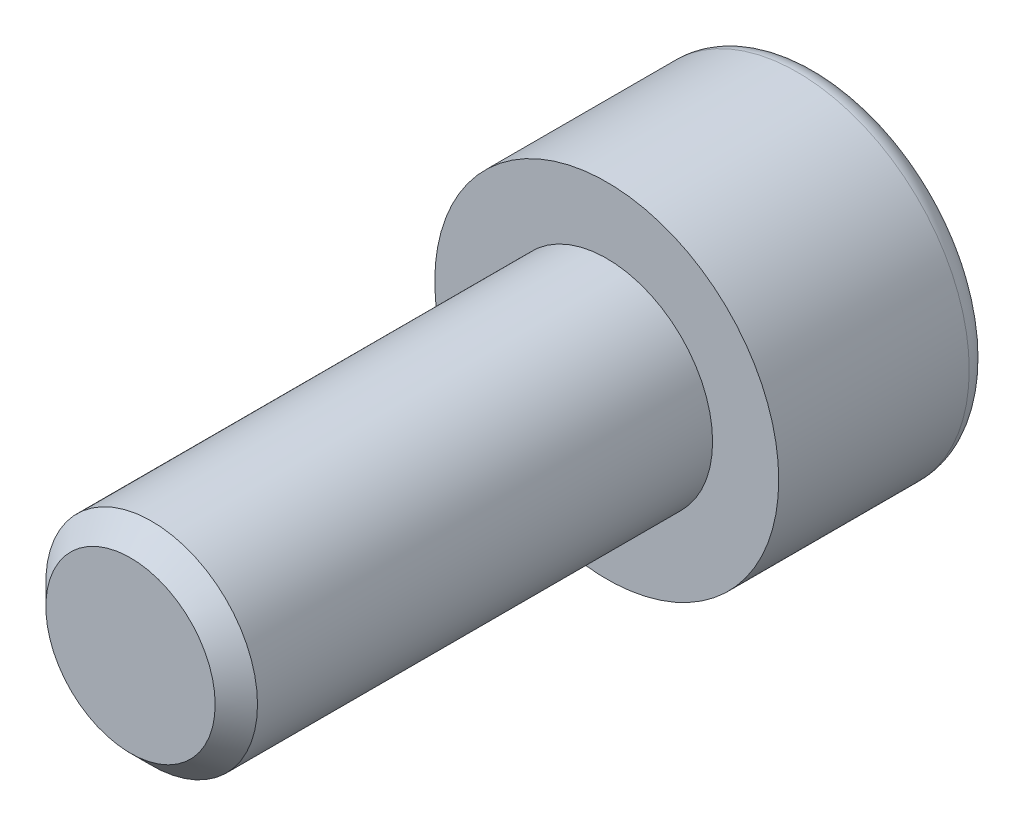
ISO-10303-21;
HEADER;
FILE_DESCRIPTION(('STEP AP214'),'2;1');
FILE_NAME('part.step','',(''),(''),'','','');
FILE_SCHEMA(('AUTOMOTIVE_DESIGN { 1 0 10303 214 1 1 1 1 }'));
ENDSEC;
DATA;
#1=APPLICATION_CONTEXT('core data for automotive mechanical design processes');
#2=APPLICATION_PROTOCOL_DEFINITION('international standard','automotive_design',2000,#1);
#3=PRODUCT_CONTEXT('',#1,'mechanical');
#4=PRODUCT('Part','Part','',(#3));
#5=PRODUCT_RELATED_PRODUCT_CATEGORY('part','',(#4));
#6=PRODUCT_DEFINITION_FORMATION('','',#4);
#7=PRODUCT_DEFINITION_CONTEXT('part definition',#1,'design');
#8=PRODUCT_DEFINITION('design','',#6,#7);
#9=PRODUCT_DEFINITION_SHAPE('','',#8);
#10=(LENGTH_UNIT() NAMED_UNIT(*) SI_UNIT(.MILLI.,.METRE.));
#11=(NAMED_UNIT(*) PLANE_ANGLE_UNIT() SI_UNIT($,.RADIAN.));
#12=(NAMED_UNIT(*) SI_UNIT($,.STERADIAN.) SOLID_ANGLE_UNIT());
#13=UNCERTAINTY_MEASURE_WITH_UNIT(LENGTH_MEASURE(1.E-05),#10,'distance_accuracy_value','');
#14=(GEOMETRIC_REPRESENTATION_CONTEXT(3) GLOBAL_UNCERTAINTY_ASSIGNED_CONTEXT((#13)) GLOBAL_UNIT_ASSIGNED_CONTEXT((#10,
#11,#12)) REPRESENTATION_CONTEXT('',''));
#15=CARTESIAN_POINT('',(0.,0.,0.));
#16=DIRECTION('',(0.,0.,1.));
#17=DIRECTION('',(1.,0.,0.));
#18=AXIS2_PLACEMENT_3D('',#15,#16,#17);
#19=CARTESIAN_POINT('',(0.,0.,-8.));
#20=DIRECTION('',(0.,0.,1.));
#21=DIRECTION('',(1.,0.,0.));
#22=AXIS2_PLACEMENT_3D('',#19,#20,#21);
#23=PLANE('',#22);
#24=CARTESIAN_POINT('',(0.,0.,-8.));
#25=DIRECTION('',(0.,0.,-1.));
#26=DIRECTION('',(-1.,0.,0.));
#27=AXIS2_PLACEMENT_3D('',#24,#25,#26);
#28=CIRCLE('',#27,5.7);
#29=CARTESIAN_POINT('',(-5.7,0.,-8.));
#30=VERTEX_POINT('',#29);
#31=EDGE_CURVE('E141',#30,#30,#28,.T.);
#32=ORIENTED_EDGE('',*,*,#31,.T.);
#33=EDGE_LOOP('',(#32));
#34=FACE_BOUND('',#33,.T.);
#35=DIRECTION('',(-0.86602540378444,0.499999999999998,0.));
#36=VECTOR('',#35,1.);
#37=CARTESIAN_POINT('',(0.,3.46410161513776,-8.));
#38=LINE('',#37,#36);
#39=CARTESIAN_POINT('',(3.,1.73205080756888,-8.));
#40=VERTEX_POINT('',#39);
#41=CARTESIAN_POINT('',(0.,3.46410161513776,-8.));
#42=VERTEX_POINT('',#41);
#43=EDGE_CURVE('E45',#40,#42,#38,.T.);
#44=ORIENTED_EDGE('',*,*,#43,.T.);
#45=DIRECTION('',(-0.866025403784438,-0.500000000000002,0.));
#46=VECTOR('',#45,1.);
#47=CARTESIAN_POINT('',(0.,3.46410161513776,-8.));
#48=LINE('',#47,#46);
#49=CARTESIAN_POINT('',(-3.,1.73205080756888,-8.));
#50=VERTEX_POINT('',#49);
#51=EDGE_CURVE('E85',#42,#50,#48,.T.);
#52=ORIENTED_EDGE('',*,*,#51,.T.);
#53=DIRECTION('',(0.,-1.,0.));
#54=VECTOR('',#53,1.);
#55=CARTESIAN_POINT('',(-3.,-1.73205080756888,-8.));
#56=LINE('',#55,#54);
#57=CARTESIAN_POINT('',(-3.,-1.73205080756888,-8.));
#58=VERTEX_POINT('',#57);
#59=EDGE_CURVE('E93',#50,#58,#56,.T.);
#60=ORIENTED_EDGE('',*,*,#59,.T.);
#61=DIRECTION('',(0.866025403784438,-0.500000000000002,0.));
#62=VECTOR('',#61,1.);
#63=CARTESIAN_POINT('',(0.,-3.46410161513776,-8.));
#64=LINE('',#63,#62);
#65=CARTESIAN_POINT('',(0.,-3.46410161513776,-8.));
#66=VERTEX_POINT('',#65);
#67=EDGE_CURVE('E111',#58,#66,#64,.T.);
#68=ORIENTED_EDGE('',*,*,#67,.T.);
#69=DIRECTION('',(0.86602540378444,0.499999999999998,0.));
#70=VECTOR('',#69,1.);
#71=CARTESIAN_POINT('',(0.,-3.46410161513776,-8.));
#72=LINE('',#71,#70);
#73=CARTESIAN_POINT('',(3.,-1.73205080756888,-8.));
#74=VERTEX_POINT('',#73);
#75=EDGE_CURVE('E114',#66,#74,#72,.T.);
#76=ORIENTED_EDGE('',*,*,#75,.T.);
#77=DIRECTION('',(0.,1.,0.));
#78=VECTOR('',#77,1.);
#79=CARTESIAN_POINT('',(3.,-1.73205080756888,-8.));
#80=LINE('',#79,#78);
#81=EDGE_CURVE('E104',#74,#40,#80,.T.);
#82=ORIENTED_EDGE('',*,*,#81,.T.);
#83=EDGE_LOOP('',(#44,#52,#60,#68,#76,#82));
#84=FACE_BOUND('',#83,.T.);
#85=ADVANCED_FACE('F31',(#34,#84),#23,.F.);
#86=CARTESIAN_POINT('',(0.,0.,-7.2));
#87=DIRECTION('',(0.,0.,-1.));
#88=DIRECTION('',(-1.,0.,0.));
#89=AXIS2_PLACEMENT_3D('',#86,#87,#88);
#90=TOROIDAL_SURFACE('',#89,5.7,0.8);
#91=ORIENTED_EDGE('',*,*,#31,.F.);
#92=EDGE_LOOP('',(#91));
#93=FACE_BOUND('',#92,.T.);
#94=CARTESIAN_POINT('',(0.,0.,-7.2));
#95=DIRECTION('',(0.,0.,-1.));
#96=DIRECTION('',(-1.,0.,0.));
#97=AXIS2_PLACEMENT_3D('',#94,#95,#96);
#98=CIRCLE('',#97,6.5);
#99=CARTESIAN_POINT('',(-6.5,0.,-7.2));
#100=VERTEX_POINT('',#99);
#101=EDGE_CURVE('E138',#100,#100,#98,.T.);
#102=ORIENTED_EDGE('',*,*,#101,.T.);
#103=EDGE_LOOP('',(#102));
#104=FACE_BOUND('',#103,.T.);
#105=ADVANCED_FACE('F160',(#93,#104),#90,.T.);
#106=CARTESIAN_POINT('',(0.,0.,0.));
#107=DIRECTION('',(0.,0.,-1.));
#108=DIRECTION('',(-1.,0.,0.));
#109=AXIS2_PLACEMENT_3D('',#106,#107,#108);
#110=CYLINDRICAL_SURFACE('',#109,6.5);
#111=ORIENTED_EDGE('',*,*,#101,.F.);
#112=EDGE_LOOP('',(#111));
#113=FACE_BOUND('',#112,.T.);
#114=CARTESIAN_POINT('',(0.,0.,0.));
#115=DIRECTION('',(0.,0.,-1.));
#116=DIRECTION('',(-1.,0.,0.));
#117=AXIS2_PLACEMENT_3D('',#114,#115,#116);
#118=CIRCLE('',#117,6.5);
#119=CARTESIAN_POINT('',(-6.5,0.,0.));
#120=VERTEX_POINT('',#119);
#121=EDGE_CURVE('E99',#120,#120,#118,.T.);
#122=ORIENTED_EDGE('',*,*,#121,.T.);
#123=EDGE_LOOP('',(#122));
#124=FACE_BOUND('',#123,.T.);
#125=ADVANCED_FACE('F165',(#113,#124),#110,.T.);
#126=CARTESIAN_POINT('',(0.,0.,0.));
#127=DIRECTION('',(0.,0.,-1.));
#128=DIRECTION('',(-1.,0.,0.));
#129=AXIS2_PLACEMENT_3D('',#126,#127,#128);
#130=PLANE('',#129);
#131=CARTESIAN_POINT('',(0.,0.,0.));
#132=DIRECTION('',(0.,0.,1.));
#133=DIRECTION('',(1.,0.,0.));
#134=AXIS2_PLACEMENT_3D('',#131,#132,#133);
#135=CIRCLE('',#134,4.);
#136=CARTESIAN_POINT('',(4.,0.,0.));
#137=VERTEX_POINT('',#136);
#138=EDGE_CURVE('E105',#137,#137,#135,.T.);
#139=ORIENTED_EDGE('',*,*,#138,.F.);
#140=EDGE_LOOP('',(#139));
#141=FACE_BOUND('',#140,.T.);
#142=ORIENTED_EDGE('',*,*,#121,.F.);
#143=EDGE_LOOP('',(#142));
#144=FACE_BOUND('',#143,.T.);
#145=ADVANCED_FACE('F173',(#141,#144),#130,.F.);
#146=CARTESIAN_POINT('',(0.,3.46410161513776,-4.));
#147=DIRECTION('',(-0.499999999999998,-0.86602540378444,0.));
#148=DIRECTION('',(0.86602540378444,-0.499999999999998,0.));
#149=AXIS2_PLACEMENT_3D('',#146,#147,#148);
#150=PLANE('',#149);
#151=ORIENTED_EDGE('',*,*,#43,.F.);
#152=DIRECTION('',(0.,0.,-1.));
#153=VECTOR('',#152,1.);
#154=CARTESIAN_POINT('',(3.,1.73205080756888,-4.));
#155=LINE('',#154,#153);
#156=CARTESIAN_POINT('',(3.,1.73205080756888,-4.));
#157=VERTEX_POINT('',#156);
#158=EDGE_CURVE('E127',#157,#40,#155,.T.);
#159=ORIENTED_EDGE('',*,*,#158,.F.);
#160=DIRECTION('',(-0.86602540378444,0.499999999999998,0.));
#161=VECTOR('',#160,1.);
#162=CARTESIAN_POINT('',(0.,3.46410161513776,-4.));
#163=LINE('',#162,#161);
#164=CARTESIAN_POINT('',(0.,3.46410161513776,-4.));
#165=VERTEX_POINT('',#164);
#166=EDGE_CURVE('E98',#157,#165,#163,.T.);
#167=ORIENTED_EDGE('',*,*,#166,.T.);
#168=DIRECTION('',(0.,0.,-1.));
#169=VECTOR('',#168,1.);
#170=CARTESIAN_POINT('',(0.,3.46410161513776,-4.));
#171=LINE('',#170,#169);
#172=EDGE_CURVE('E87',#165,#42,#171,.T.);
#173=ORIENTED_EDGE('',*,*,#172,.T.);
#174=EDGE_LOOP('',(#151,#159,#167,#173));
#175=FACE_BOUND('',#174,.T.);
#176=ADVANCED_FACE('F96',(#175),#150,.T.);
#177=CARTESIAN_POINT('',(0.,3.46410161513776,-4.));
#178=DIRECTION('',(0.500000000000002,-0.866025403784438,0.));
#179=DIRECTION('',(0.866025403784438,0.500000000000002,0.));
#180=AXIS2_PLACEMENT_3D('',#177,#178,#179);
#181=PLANE('',#180);
#182=ORIENTED_EDGE('',*,*,#51,.F.);
#183=ORIENTED_EDGE('',*,*,#172,.F.);
#184=DIRECTION('',(-0.866025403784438,-0.500000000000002,0.));
#185=VECTOR('',#184,1.);
#186=CARTESIAN_POINT('',(0.,3.46410161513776,-4.));
#187=LINE('',#186,#185);
#188=CARTESIAN_POINT('',(-3.,1.73205080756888,-4.));
#189=VERTEX_POINT('',#188);
#190=EDGE_CURVE('E118',#165,#189,#187,.T.);
#191=ORIENTED_EDGE('',*,*,#190,.T.);
#192=DIRECTION('',(0.,0.,-1.));
#193=VECTOR('',#192,1.);
#194=CARTESIAN_POINT('',(-3.,1.73205080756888,-4.));
#195=LINE('',#194,#193);
#196=EDGE_CURVE('E89',#189,#50,#195,.T.);
#197=ORIENTED_EDGE('',*,*,#196,.T.);
#198=EDGE_LOOP('',(#182,#183,#191,#197));
#199=FACE_BOUND('',#198,.T.);
#200=ADVANCED_FACE('F86',(#199),#181,.T.);
#201=CARTESIAN_POINT('',(-3.,-1.73205080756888,-4.));
#202=DIRECTION('',(1.,0.,0.));
#203=DIRECTION('',(0.,0.,-1.));
#204=AXIS2_PLACEMENT_3D('',#201,#202,#203);
#205=PLANE('',#204);
#206=ORIENTED_EDGE('',*,*,#59,.F.);
#207=ORIENTED_EDGE('',*,*,#196,.F.);
#208=DIRECTION('',(0.,-1.,0.));
#209=VECTOR('',#208,1.);
#210=CARTESIAN_POINT('',(-3.,-1.73205080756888,-4.));
#211=LINE('',#210,#209);
#212=CARTESIAN_POINT('',(-3.,-1.73205080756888,-4.));
#213=VERTEX_POINT('',#212);
#214=EDGE_CURVE('E120',#189,#213,#211,.T.);
#215=ORIENTED_EDGE('',*,*,#214,.T.);
#216=DIRECTION('',(0.,0.,-1.));
#217=VECTOR('',#216,1.);
#218=CARTESIAN_POINT('',(-3.,-1.73205080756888,-4.));
#219=LINE('',#218,#217);
#220=EDGE_CURVE('E133',#213,#58,#219,.T.);
#221=ORIENTED_EDGE('',*,*,#220,.T.);
#222=EDGE_LOOP('',(#206,#207,#215,#221));
#223=FACE_BOUND('',#222,.T.);
#224=ADVANCED_FACE('F188',(#223),#205,.T.);
#225=CARTESIAN_POINT('',(0.,-3.46410161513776,-4.));
#226=DIRECTION('',(0.500000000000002,0.866025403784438,0.));
#227=DIRECTION('',(-0.866025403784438,0.500000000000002,0.));
#228=AXIS2_PLACEMENT_3D('',#225,#226,#227);
#229=PLANE('',#228);
#230=ORIENTED_EDGE('',*,*,#67,.F.);
#231=ORIENTED_EDGE('',*,*,#220,.F.);
#232=DIRECTION('',(0.866025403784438,-0.500000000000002,0.));
#233=VECTOR('',#232,1.);
#234=CARTESIAN_POINT('',(0.,-3.46410161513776,-4.));
#235=LINE('',#234,#233);
#236=CARTESIAN_POINT('',(0.,-3.46410161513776,-4.));
#237=VERTEX_POINT('',#236);
#238=EDGE_CURVE('E122',#213,#237,#235,.T.);
#239=ORIENTED_EDGE('',*,*,#238,.T.);
#240=DIRECTION('',(0.,0.,-1.));
#241=VECTOR('',#240,1.);
#242=CARTESIAN_POINT('',(0.,-3.46410161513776,-4.));
#243=LINE('',#242,#241);
#244=EDGE_CURVE('E131',#237,#66,#243,.T.);
#245=ORIENTED_EDGE('',*,*,#244,.T.);
#246=EDGE_LOOP('',(#230,#231,#239,#245));
#247=FACE_BOUND('',#246,.T.);
#248=ADVANCED_FACE('F191',(#247),#229,.T.);
#249=CARTESIAN_POINT('',(0.,-3.46410161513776,-4.));
#250=DIRECTION('',(-0.499999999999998,0.86602540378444,0.));
#251=DIRECTION('',(-0.86602540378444,-0.499999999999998,0.));
#252=AXIS2_PLACEMENT_3D('',#249,#250,#251);
#253=PLANE('',#252);
#254=ORIENTED_EDGE('',*,*,#75,.F.);
#255=ORIENTED_EDGE('',*,*,#244,.F.);
#256=DIRECTION('',(0.86602540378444,0.499999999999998,0.));
#257=VECTOR('',#256,1.);
#258=CARTESIAN_POINT('',(0.,-3.46410161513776,-4.));
#259=LINE('',#258,#257);
#260=CARTESIAN_POINT('',(3.,-1.73205080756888,-4.));
#261=VERTEX_POINT('',#260);
#262=EDGE_CURVE('E124',#237,#261,#259,.T.);
#263=ORIENTED_EDGE('',*,*,#262,.T.);
#264=DIRECTION('',(0.,0.,-1.));
#265=VECTOR('',#264,1.);
#266=CARTESIAN_POINT('',(3.,-1.73205080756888,-4.));
#267=LINE('',#266,#265);
#268=EDGE_CURVE('E129',#261,#74,#267,.T.);
#269=ORIENTED_EDGE('',*,*,#268,.T.);
#270=EDGE_LOOP('',(#254,#255,#263,#269));
#271=FACE_BOUND('',#270,.T.);
#272=ADVANCED_FACE('F195',(#271),#253,.T.);
#273=CARTESIAN_POINT('',(3.,-1.73205080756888,-4.));
#274=DIRECTION('',(-1.,0.,0.));
#275=DIRECTION('',(0.,0.,1.));
#276=AXIS2_PLACEMENT_3D('',#273,#274,#275);
#277=PLANE('',#276);
#278=ORIENTED_EDGE('',*,*,#81,.F.);
#279=ORIENTED_EDGE('',*,*,#268,.F.);
#280=DIRECTION('',(0.,1.,0.));
#281=VECTOR('',#280,1.);
#282=CARTESIAN_POINT('',(3.,-1.73205080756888,-4.));
#283=LINE('',#282,#281);
#284=EDGE_CURVE('E52',#261,#157,#283,.T.);
#285=ORIENTED_EDGE('',*,*,#284,.T.);
#286=ORIENTED_EDGE('',*,*,#158,.T.);
#287=EDGE_LOOP('',(#278,#279,#285,#286));
#288=FACE_BOUND('',#287,.T.);
#289=ADVANCED_FACE('F199',(#288),#277,.T.);
#290=CARTESIAN_POINT('',(3.,1.73205080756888,-4.));
#291=DIRECTION('',(0.,0.,1.));
#292=DIRECTION('',(1.,0.,0.));
#293=AXIS2_PLACEMENT_3D('',#290,#291,#292);
#294=PLANE('',#293);
#295=ORIENTED_EDGE('',*,*,#166,.F.);
#296=ORIENTED_EDGE('',*,*,#284,.F.);
#297=ORIENTED_EDGE('',*,*,#262,.F.);
#298=ORIENTED_EDGE('',*,*,#238,.F.);
#299=ORIENTED_EDGE('',*,*,#214,.F.);
#300=ORIENTED_EDGE('',*,*,#190,.F.);
#301=EDGE_LOOP('',(#295,#296,#297,#298,#299,#300));
#302=FACE_BOUND('',#301,.T.);
#303=ADVANCED_FACE('F203',(#302),#294,.F.);
#304=CARTESIAN_POINT('',(0.,0.,18.));
#305=DIRECTION('',(0.,0.,1.));
#306=DIRECTION('',(1.,0.,0.));
#307=AXIS2_PLACEMENT_3D('',#304,#305,#306);
#308=PLANE('',#307);
#309=CARTESIAN_POINT('',(0.,0.,18.));
#310=DIRECTION('',(0.,0.,1.));
#311=DIRECTION('',(1.,0.,0.));
#312=AXIS2_PLACEMENT_3D('',#309,#310,#311);
#313=CIRCLE('',#312,3.2);
#314=CARTESIAN_POINT('',(3.20000000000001,0.,18.));
#315=VERTEX_POINT('',#314);
#316=EDGE_CURVE('E38',#315,#315,#313,.T.);
#317=ORIENTED_EDGE('',*,*,#316,.T.);
#318=EDGE_LOOP('',(#317));
#319=FACE_BOUND('',#318,.T.);
#320=ADVANCED_FACE('F146',(#319),#308,.T.);
#321=CARTESIAN_POINT('',(0.,0.,0.));
#322=DIRECTION('',(0.,0.,1.));
#323=DIRECTION('',(1.,0.,0.));
#324=AXIS2_PLACEMENT_3D('',#321,#322,#323);
#325=CYLINDRICAL_SURFACE('',#324,4.);
#326=CARTESIAN_POINT('',(0.,0.,17.2));
#327=DIRECTION('',(0.,0.,1.));
#328=DIRECTION('',(1.,0.,0.));
#329=AXIS2_PLACEMENT_3D('',#326,#327,#328);
#330=CIRCLE('',#329,4.);
#331=CARTESIAN_POINT('',(4.,0.,17.2));
#332=VERTEX_POINT('',#331);
#333=EDGE_CURVE('E11',#332,#332,#330,.F.);
#334=ORIENTED_EDGE('',*,*,#333,.T.);
#335=EDGE_LOOP('',(#334));
#336=FACE_BOUND('',#335,.T.);
#337=ORIENTED_EDGE('',*,*,#138,.T.);
#338=EDGE_LOOP('',(#337));
#339=FACE_BOUND('',#338,.T.);
#340=ADVANCED_FACE('F150',(#336,#339),#325,.T.);
#341=CARTESIAN_POINT('',(0.,0.,18.));
#342=DIRECTION('',(0.,0.,-1.));
#343=DIRECTION('',(-1.,0.,0.));
#344=AXIS2_PLACEMENT_3D('',#341,#342,#343);
#345=CONICAL_SURFACE('',#344,3.2,0.785398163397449);
#346=ORIENTED_EDGE('',*,*,#333,.F.);
#347=EDGE_LOOP('',(#346));
#348=FACE_BOUND('',#347,.T.);
#349=ORIENTED_EDGE('',*,*,#316,.F.);
#350=EDGE_LOOP('',(#349));
#351=FACE_BOUND('',#350,.T.);
#352=ADVANCED_FACE('F148',(#348,#351),#345,.T.);
#353=CLOSED_SHELL('',(#85,#105,#125,#145,#176,#200,#224,#248,#272,#289,#303,#320,#340,#352));
#354=MANIFOLD_SOLID_BREP('B2',#353);
#355=ADVANCED_BREP_SHAPE_REPRESENTATION('',(#18,#354),#14);
#356=SHAPE_DEFINITION_REPRESENTATION(#9,#355);
ENDSEC;
END-ISO-10303-21;
